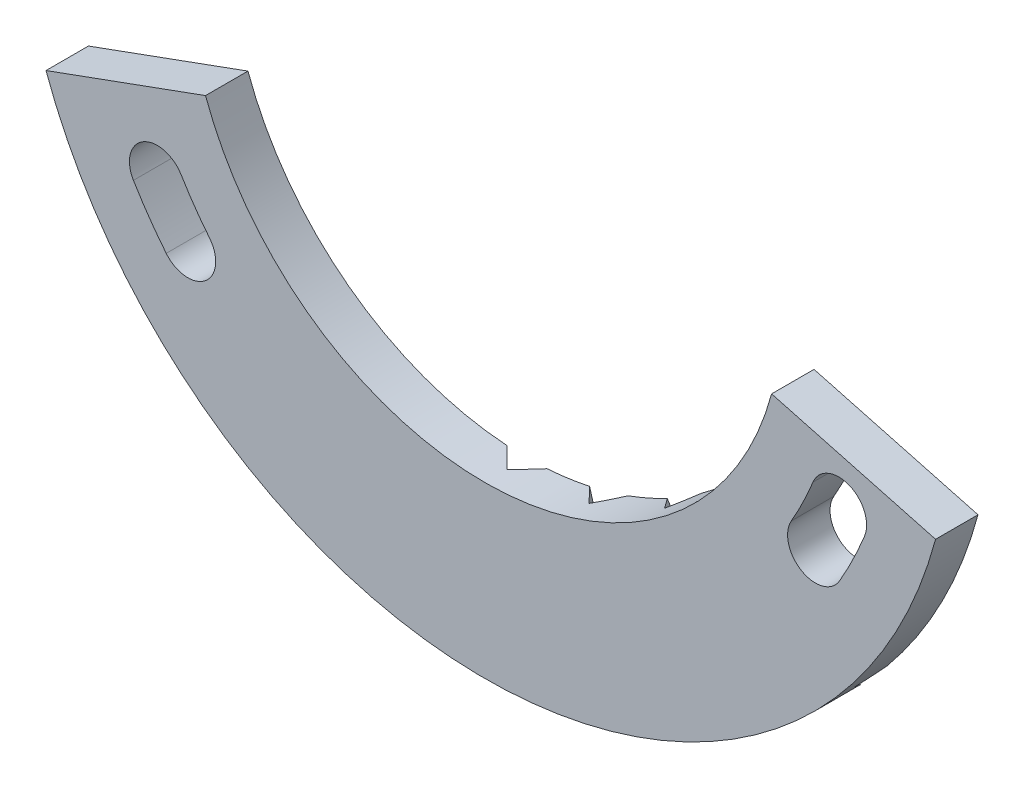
ISO-10303-21;
HEADER;
FILE_DESCRIPTION(('STEP AP214'),'2;1');
FILE_NAME('part.step','',(''),(''),'','','');
FILE_SCHEMA(('AUTOMOTIVE_DESIGN { 1 0 10303 214 1 1 1 1 }'));
ENDSEC;
DATA;
#1=APPLICATION_CONTEXT('core data for automotive mechanical design processes');
#2=APPLICATION_PROTOCOL_DEFINITION('international standard','automotive_design',2000,#1);
#3=PRODUCT_CONTEXT('',#1,'mechanical');
#4=PRODUCT('Part','Part','',(#3));
#5=PRODUCT_RELATED_PRODUCT_CATEGORY('part','',(#4));
#6=PRODUCT_DEFINITION_FORMATION('','',#4);
#7=PRODUCT_DEFINITION_CONTEXT('part definition',#1,'design');
#8=PRODUCT_DEFINITION('design','',#6,#7);
#9=PRODUCT_DEFINITION_SHAPE('','',#8);
#10=(LENGTH_UNIT() NAMED_UNIT(*) SI_UNIT(.MILLI.,.METRE.));
#11=(NAMED_UNIT(*) PLANE_ANGLE_UNIT() SI_UNIT($,.RADIAN.));
#12=(NAMED_UNIT(*) SI_UNIT($,.STERADIAN.) SOLID_ANGLE_UNIT());
#13=UNCERTAINTY_MEASURE_WITH_UNIT(LENGTH_MEASURE(1.E-05),#10,'distance_accuracy_value','');
#14=(GEOMETRIC_REPRESENTATION_CONTEXT(3) GLOBAL_UNCERTAINTY_ASSIGNED_CONTEXT((#13)) GLOBAL_UNIT_ASSIGNED_CONTEXT((#10,
#11,#12)) REPRESENTATION_CONTEXT('',''));
#15=CARTESIAN_POINT('',(0.,0.,0.));
#16=DIRECTION('',(0.,0.,1.));
#17=DIRECTION('',(1.,0.,0.));
#18=AXIS2_PLACEMENT_3D('',#15,#16,#17);
#19=CARTESIAN_POINT('',(0.,28.575,0.));
#20=DIRECTION('',(0.,0.,1.));
#21=DIRECTION('',(1.,0.,0.));
#22=AXIS2_PLACEMENT_3D('',#19,#20,#21);
#23=PLANE('',#22);
#24=CARTESIAN_POINT('',(0.,28.575,0.));
#25=DIRECTION('',(0.,0.,1.));
#26=DIRECTION('',(1.,0.,0.));
#27=AXIS2_PLACEMENT_3D('',#24,#25,#26);
#28=CIRCLE('',#27,34.925);
#29=CARTESIAN_POINT('',(11.0542762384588,-4.55442199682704,0.));
#30=VERTEX_POINT('',#29);
#31=CARTESIAN_POINT('',(17.2232039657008,-1.80783841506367,0.));
#32=VERTEX_POINT('',#31);
#33=EDGE_CURVE('E409',#30,#32,#28,.T.);
#34=ORIENTED_EDGE('',*,*,#33,.F.);
#35=DIRECTION('',(-0.275637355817,0.961261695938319,0.));
#36=VECTOR('',#35,1.);
#37=CARTESIAN_POINT('',(1.43645761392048,28.9868975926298,0.));
#38=LINE('',#37,#36);
#39=CARTESIAN_POINT('',(7.54863474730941,7.67120277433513,0.));
#40=VERTEX_POINT('',#39);
#41=EDGE_CURVE('E305',#30,#40,#38,.T.);
#42=ORIENTED_EDGE('',*,*,#41,.T.);
#43=CARTESIAN_POINT('',(0.,28.575,0.));
#44=DIRECTION('',(0.,0.,-1.));
#45=DIRECTION('',(1.,0.,0.));
#46=AXIS2_PLACEMENT_3D('',#43,#44,#45);
#47=CIRCLE('',#46,22.225);
#48=CARTESIAN_POINT('',(10.4835261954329,8.97790063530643,0.));
#49=VERTEX_POINT('',#48);
#50=EDGE_CURVE('E394',#49,#40,#47,.T.);
#51=ORIENTED_EDGE('',*,*,#50,.F.);
#52=DIRECTION('',(0.529919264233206,-0.848048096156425,0.));
#53=VECTOR('',#52,1.);
#54=CARTESIAN_POINT('',(-1.26727731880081,27.7831172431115,0.));
#55=LINE('',#54,#53);
#56=EDGE_CURVE('E287',#49,#32,#55,.T.);
#57=ORIENTED_EDGE('',*,*,#56,.T.);
#58=EDGE_LOOP('',(#34,#42,#51,#57));
#59=FACE_BOUND('',#58,.T.);
#60=ADVANCED_FACE('F37',(#59),#23,.F.);
#61=CARTESIAN_POINT('',(19.7577586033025,-0.224072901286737,0.));
#62=VERTEX_POINT('',#61);
#63=CARTESIAN_POINT('',(24.9306514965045,4.11649961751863,0.));
#64=VERTEX_POINT('',#63);
#65=EDGE_CURVE('E405',#62,#64,#28,.T.);
#66=ORIENTED_EDGE('',*,*,#65,.F.);
#67=DIRECTION('',(-0.529919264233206,0.848048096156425,0.));
#68=VECTOR('',#67,1.);
#69=CARTESIAN_POINT('',(1.26727731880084,29.3668827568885,0.));
#70=LINE('',#69,#68);
#71=CARTESIAN_POINT('',(13.0180808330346,10.5616661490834,0.));
#72=VERTEX_POINT('',#71);
#73=EDGE_CURVE('E293',#62,#72,#70,.T.);
#74=ORIENTED_EDGE('',*,*,#73,.T.);
#75=CARTESIAN_POINT('',(15.4791048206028,12.6267104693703,0.));
#76=VERTEX_POINT('',#75);
#77=EDGE_CURVE('E342',#76,#72,#47,.T.);
#78=ORIENTED_EDGE('',*,*,#77,.F.);
#79=DIRECTION('',(0.743144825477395,-0.669130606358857,0.));
#80=VECTOR('',#79,1.);
#81=CARTESIAN_POINT('',(-0.999912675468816,27.464484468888,0.));
#82=LINE('',#81,#80);
#83=EDGE_CURVE('E275',#76,#64,#82,.T.);
#84=ORIENTED_EDGE('',*,*,#83,.T.);
#85=EDGE_LOOP('',(#66,#74,#78,#84));
#86=FACE_BOUND('',#85,.T.);
#87=ADVANCED_FACE('F403',(#86),#23,.F.);
#88=CARTESIAN_POINT('',(26.4942786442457,17.8706165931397,0.));
#89=DIRECTION('',(0.,0.,1.));
#90=DIRECTION('',(1.,0.,0.));
#91=AXIS2_PLACEMENT_3D('',#88,#89,#90);
#92=CIRCLE('',#91,2.08279999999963);
#93=CARTESIAN_POINT('',(28.4254171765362,17.0903859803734,0.));
#94=VERTEX_POINT('',#93);
#95=CARTESIAN_POINT('',(24.5631401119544,18.6508472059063,0.));
#96=VERTEX_POINT('',#95);
#97=EDGE_CURVE('E245',#94,#96,#92,.T.);
#98=ORIENTED_EDGE('',*,*,#97,.T.);
#99=CARTESIAN_POINT('',(5.23886489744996E-13,28.5749999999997,0.));
#100=DIRECTION('',(0.,0.,-1.));
#101=DIRECTION('',(1.,0.,0.));
#102=AXIS2_PLACEMENT_3D('',#99,#100,#101);
#103=CIRCLE('',#102,26.4921999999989);
#104=CARTESIAN_POINT('',(22.9429182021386,15.3289000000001,0.));
#105=VERTEX_POINT('',#104);
#106=EDGE_CURVE('E235',#96,#105,#103,.T.);
#107=ORIENTED_EDGE('',*,*,#106,.T.);
#108=CARTESIAN_POINT('',(24.7466759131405,14.2875000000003,0.));
#109=DIRECTION('',(0.,0.,1.));
#110=DIRECTION('',(1.,0.,0.));
#111=AXIS2_PLACEMENT_3D('',#108,#109,#110);
#112=CIRCLE('',#111,2.08279999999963);
#113=CARTESIAN_POINT('',(26.5504336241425,13.2461000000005,0.));
#114=VERTEX_POINT('',#113);
#115=EDGE_CURVE('E238',#105,#114,#112,.T.);
#116=ORIENTED_EDGE('',*,*,#115,.T.);
#117=CARTESIAN_POINT('',(5.23886489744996E-13,28.5749999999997,0.));
#118=DIRECTION('',(0.,0.,1.));
#119=DIRECTION('',(1.,0.,0.));
#120=AXIS2_PLACEMENT_3D('',#117,#118,#119);
#121=CIRCLE('',#120,30.6577999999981);
#122=EDGE_CURVE('E242',#114,#94,#121,.T.);
#123=ORIENTED_EDGE('',*,*,#122,.T.);
#124=EDGE_LOOP('',(#98,#107,#116,#123));
#125=FACE_BOUND('',#124,.T.);
#126=CARTESIAN_POINT('',(26.9304768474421,6.3375306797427,0.));
#127=VERTEX_POINT('',#126);
#128=CARTESIAN_POINT('',(33.7349594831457,19.5357448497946,0.));
#129=VERTEX_POINT('',#128);
#130=EDGE_CURVE('E345',#127,#129,#28,.T.);
#131=ORIENTED_EDGE('',*,*,#130,.F.);
#132=DIRECTION('',(-0.743144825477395,0.669130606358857,0.));
#133=VECTOR('',#132,1.);
#134=CARTESIAN_POINT('',(0.999912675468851,29.685515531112,0.));
#135=LINE('',#134,#133);
#136=CARTESIAN_POINT('',(17.4789301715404,14.8477415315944,0.));
#137=VERTEX_POINT('',#136);
#138=EDGE_CURVE('E281',#127,#137,#135,.T.);
#139=ORIENTED_EDGE('',*,*,#138,.T.);
#140=CARTESIAN_POINT('',(21.4677014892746,22.8227467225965,0.));
#141=VERTEX_POINT('',#140);
#142=EDGE_CURVE('E338',#141,#137,#47,.T.);
#143=ORIENTED_EDGE('',*,*,#142,.F.);
#144=DIRECTION('',(-0.965925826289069,0.258819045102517,0.));
#145=VECTOR('',#144,1.);
#146=CARTESIAN_POINT('',(21.4677014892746,22.8227467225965,0.));
#147=LINE('',#146,#145);
#148=EDGE_CURVE('E331',#129,#141,#147,.T.);
#149=ORIENTED_EDGE('',*,*,#148,.F.);
#150=EDGE_LOOP('',(#131,#139,#143,#149));
#151=FACE_BOUND('',#150,.T.);
#152=ADVANCED_FACE('F431',(#125,#151),#23,.F.);
#153=CARTESIAN_POINT('',(4.6757195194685,6.84740758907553,0.));
#154=VERTEX_POINT('',#153);
#155=CARTESIAN_POINT('',(1.49434604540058,6.40029470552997,0.));
#156=VERTEX_POINT('',#155);
#157=EDGE_CURVE('E343',#154,#156,#47,.T.);
#158=ORIENTED_EDGE('',*,*,#157,.F.);
#159=DIRECTION('',(0.275637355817,-0.961261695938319,0.));
#160=VECTOR('',#159,1.);
#161=CARTESIAN_POINT('',(-1.43645761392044,28.1631024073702,0.));
#162=LINE('',#161,#160);
#163=CARTESIAN_POINT('',(8.18136101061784,-5.37821718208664,0.));
#164=VERTEX_POINT('',#163);
#165=EDGE_CURVE('E299',#154,#164,#162,.T.);
#166=ORIENTED_EDGE('',*,*,#165,.T.);
#167=CARTESIAN_POINT('',(1.49434604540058,-6.31801584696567,0.));
#168=VERTEX_POINT('',#167);
#169=EDGE_CURVE('E349',#168,#164,#28,.T.);
#170=ORIENTED_EDGE('',*,*,#169,.F.);
#171=DIRECTION('',(0.,1.,0.));
#172=VECTOR('',#171,1.);
#173=CARTESIAN_POINT('',(1.49434604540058,28.575,0.));
#174=LINE('',#173,#172);
#175=EDGE_CURVE('E365',#168,#156,#174,.T.);
#176=ORIENTED_EDGE('',*,*,#175,.T.);
#177=EDGE_LOOP('',(#158,#166,#170,#176));
#178=FACE_BOUND('',#177,.T.);
#179=ADVANCED_FACE('F391',(#178),#23,.F.);
#180=CARTESIAN_POINT('',(0.,28.575,3.175));
#181=DIRECTION('',(0.,0.,-1.));
#182=DIRECTION('',(-1.,0.,0.));
#183=AXIS2_PLACEMENT_3D('',#180,#181,#182);
#184=CYLINDRICAL_SURFACE('',#183,22.225);
#185=ORIENTED_EDGE('',*,*,#50,.T.);
#186=CARTESIAN_POINT('',(0.,28.575,1.49434604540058));
#187=DIRECTION('',(0.679714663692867,0.19490504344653,0.707106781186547));
#188=DIRECTION('',(0.679714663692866,0.19490504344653,-0.707106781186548));
#189=AXIS2_PLACEMENT_3D('',#186,#187,#188);
#190=ELLIPSE('',#189,31.4308964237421,22.225);
#191=CARTESIAN_POINT('',(6.12604023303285,7.21095880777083,1.49434604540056));
#192=VERTEX_POINT('',#191);
#193=EDGE_CURVE('E308',#40,#192,#190,.F.);
#194=ORIENTED_EDGE('',*,*,#193,.T.);
#195=CARTESIAN_POINT('',(0.,28.575,1.49434604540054));
#196=DIRECTION('',(-0.679714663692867,-0.19490504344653,0.707106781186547));
#197=DIRECTION('',(-0.679714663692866,-0.19490504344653,-0.707106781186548));
#198=AXIS2_PLACEMENT_3D('',#195,#196,#197);
#199=ELLIPSE('',#198,31.4308964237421,22.225);
#200=EDGE_CURVE('E302',#192,#154,#199,.F.);
#201=ORIENTED_EDGE('',*,*,#200,.T.);
#202=ORIENTED_EDGE('',*,*,#157,.T.);
#203=CARTESIAN_POINT('',(0.,28.575,1.49434604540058));
#204=DIRECTION('',(0.707106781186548,0.,0.707106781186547));
#205=DIRECTION('',(0.707106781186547,0.,-0.707106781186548));
#206=AXIS2_PLACEMENT_3D('',#203,#204,#205);
#207=ELLIPSE('',#206,31.4308964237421,22.225);
#208=CARTESIAN_POINT('',(0.,6.34999999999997,1.49434604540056));
#209=VERTEX_POINT('',#208);
#210=EDGE_CURVE('E323',#156,#209,#207,.F.);
#211=ORIENTED_EDGE('',*,*,#210,.T.);
#212=CARTESIAN_POINT('',(0.,28.575,1.49434604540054));
#213=DIRECTION('',(-0.707106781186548,0.,0.707106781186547));
#214=DIRECTION('',(-0.707106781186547,0.,-0.707106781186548));
#215=AXIS2_PLACEMENT_3D('',#212,#213,#214);
#216=ELLIPSE('',#215,31.4308964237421,22.225);
#217=CARTESIAN_POINT('',(-1.49434604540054,6.40029470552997,0.));
#218=VERTEX_POINT('',#217);
#219=EDGE_CURVE('E317',#209,#218,#216,.F.);
#220=ORIENTED_EDGE('',*,*,#219,.T.);
#221=CARTESIAN_POINT('',(-20.8846684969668,20.973602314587,0.));
#222=VERTEX_POINT('',#221);
#223=EDGE_CURVE('E326',#218,#222,#47,.T.);
#224=ORIENTED_EDGE('',*,*,#223,.T.);
#225=DIRECTION('',(0.,0.,-1.));
#226=VECTOR('',#225,1.);
#227=CARTESIAN_POINT('',(-20.8846684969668,20.973602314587,3.175));
#228=LINE('',#227,#226);
#229=CARTESIAN_POINT('',(-20.8846684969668,20.973602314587,3.175));
#230=VERTEX_POINT('',#229);
#231=EDGE_CURVE('E359',#230,#222,#228,.T.);
#232=ORIENTED_EDGE('',*,*,#231,.F.);
#233=CARTESIAN_POINT('',(0.,28.575,3.175));
#234=DIRECTION('',(0.,0.,-1.));
#235=DIRECTION('',(1.,0.,0.));
#236=AXIS2_PLACEMENT_3D('',#233,#234,#235);
#237=CIRCLE('',#236,22.225);
#238=CARTESIAN_POINT('',(21.4677014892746,22.8227467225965,3.175));
#239=VERTEX_POINT('',#238);
#240=EDGE_CURVE('E327',#239,#230,#237,.T.);
#241=ORIENTED_EDGE('',*,*,#240,.F.);
#242=DIRECTION('',(0.,0.,-1.));
#243=VECTOR('',#242,1.);
#244=CARTESIAN_POINT('',(21.4677014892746,22.8227467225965,3.175));
#245=LINE('',#244,#243);
#246=EDGE_CURVE('E337',#239,#141,#245,.T.);
#247=ORIENTED_EDGE('',*,*,#246,.T.);
#248=ORIENTED_EDGE('',*,*,#142,.T.);
#249=CARTESIAN_POINT('',(0.,28.575,1.49434604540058));
#250=DIRECTION('',(0.473146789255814,0.52548274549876,0.707106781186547));
#251=DIRECTION('',(0.473146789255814,0.525482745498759,-0.707106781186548));
#252=AXIS2_PLACEMENT_3D('',#249,#250,#251);
#253=ELLIPSE('',#252,31.4308964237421,22.225);
#254=CARTESIAN_POINT('',(16.5163937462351,13.7035722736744,1.49434604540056));
#255=VERTEX_POINT('',#254);
#256=EDGE_CURVE('E284',#137,#255,#253,.F.);
#257=ORIENTED_EDGE('',*,*,#256,.T.);
#258=CARTESIAN_POINT('',(0.,28.575,1.49434604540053));
#259=DIRECTION('',(-0.473146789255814,-0.52548274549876,0.707106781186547));
#260=DIRECTION('',(-0.473146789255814,-0.525482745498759,-0.707106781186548));
#261=AXIS2_PLACEMENT_3D('',#258,#259,#260);
#262=ELLIPSE('',#261,31.4308964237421,22.225);
#263=EDGE_CURVE('E278',#255,#76,#262,.F.);
#264=ORIENTED_EDGE('',*,*,#263,.T.);
#265=ORIENTED_EDGE('',*,*,#77,.T.);
#266=CARTESIAN_POINT('',(0.,28.575,1.49434604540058));
#267=DIRECTION('',(0.59966055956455,0.374709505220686,0.707106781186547));
#268=DIRECTION('',(0.599660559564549,0.374709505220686,-0.707106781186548));
#269=AXIS2_PLACEMENT_3D('',#266,#267,#268);
#270=ELLIPSE('',#269,31.4308964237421,22.225);
#271=CARTESIAN_POINT('',(11.777455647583,9.72713106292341,1.49434604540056));
#272=VERTEX_POINT('',#271);
#273=EDGE_CURVE('E296',#72,#272,#270,.F.);
#274=ORIENTED_EDGE('',*,*,#273,.T.);
#275=CARTESIAN_POINT('',(0.,28.575,1.49434604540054));
#276=DIRECTION('',(-0.59966055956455,-0.374709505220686,0.707106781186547));
#277=DIRECTION('',(-0.599660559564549,-0.374709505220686,-0.707106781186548));
#278=AXIS2_PLACEMENT_3D('',#275,#276,#277);
#279=ELLIPSE('',#278,31.4308964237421,22.225);
#280=EDGE_CURVE('E290',#272,#49,#279,.F.);
#281=ORIENTED_EDGE('',*,*,#280,.T.);
#282=EDGE_LOOP('',(#185,#194,#201,#202,#211,#220,#224,#232,#241,#247,#248,#257,#264,#265,#274,#281));
#283=FACE_BOUND('',#282,.T.);
#284=ADVANCED_FACE('F39',(#283),#184,.F.);
#285=CARTESIAN_POINT('',(-20.8846684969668,20.973602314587,3.175));
#286=DIRECTION('',(0.342020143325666,-0.939692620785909,0.));
#287=DIRECTION('',(0.939692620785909,0.342020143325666,0.));
#288=AXIS2_PLACEMENT_3D('',#285,#286,#287);
#289=PLANE('',#288);
#290=DIRECTION('',(-0.939692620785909,-0.342020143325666,0.));
#291=VECTOR('',#290,1.);
#292=CARTESIAN_POINT('',(-20.8846684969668,20.973602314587,0.));
#293=LINE('',#292,#291);
#294=CARTESIAN_POINT('',(-32.8187647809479,16.6299464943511,0.));
#295=VERTEX_POINT('',#294);
#296=EDGE_CURVE('E341',#222,#295,#293,.T.);
#297=ORIENTED_EDGE('',*,*,#296,.T.);
#298=DIRECTION('',(0.,0.,-1.));
#299=VECTOR('',#298,1.);
#300=CARTESIAN_POINT('',(-32.8187647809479,16.6299464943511,3.175));
#301=LINE('',#300,#299);
#302=CARTESIAN_POINT('',(-32.8187647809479,16.6299464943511,3.175));
#303=VERTEX_POINT('',#302);
#304=EDGE_CURVE('E356',#303,#295,#301,.T.);
#305=ORIENTED_EDGE('',*,*,#304,.F.);
#306=DIRECTION('',(-0.939692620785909,-0.342020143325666,0.));
#307=VECTOR('',#306,1.);
#308=CARTESIAN_POINT('',(-20.8846684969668,20.973602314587,3.175));
#309=LINE('',#308,#307);
#310=EDGE_CURVE('E330',#230,#303,#309,.T.);
#311=ORIENTED_EDGE('',*,*,#310,.F.);
#312=ORIENTED_EDGE('',*,*,#231,.T.);
#313=EDGE_LOOP('',(#297,#305,#311,#312));
#314=FACE_BOUND('',#313,.T.);
#315=ADVANCED_FACE('F451',(#314),#289,.F.);
#316=CARTESIAN_POINT('',(0.,28.575,3.175));
#317=DIRECTION('',(0.,0.,-1.));
#318=DIRECTION('',(-1.,0.,0.));
#319=AXIS2_PLACEMENT_3D('',#316,#317,#318);
#320=CYLINDRICAL_SURFACE('',#319,34.925);
#321=CARTESIAN_POINT('',(0.,28.575,1.49434604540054));
#322=DIRECTION('',(-0.679714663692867,-0.19490504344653,0.707106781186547));
#323=DIRECTION('',(-0.679714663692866,-0.19490504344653,-0.707106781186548));
#324=AXIS2_PLACEMENT_3D('',#321,#322,#323);
#325=ELLIPSE('',#324,49.3914086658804,34.925);
#326=CARTESIAN_POINT('',(9.62663465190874,-4.99706473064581,1.49434604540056));
#327=VERTEX_POINT('',#326);
#328=EDGE_CURVE('E45',#164,#327,#325,.T.);
#329=ORIENTED_EDGE('',*,*,#328,.T.);
#330=CARTESIAN_POINT('',(0.,28.575,1.49434604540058));
#331=DIRECTION('',(0.679714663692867,0.19490504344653,0.707106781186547));
#332=DIRECTION('',(0.679714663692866,0.19490504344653,-0.707106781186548));
#333=AXIS2_PLACEMENT_3D('',#330,#331,#332);
#334=ELLIPSE('',#333,49.3914086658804,34.925);
#335=EDGE_CURVE('E11',#327,#30,#334,.T.);
#336=ORIENTED_EDGE('',*,*,#335,.T.);
#337=ORIENTED_EDGE('',*,*,#33,.T.);
#338=CARTESIAN_POINT('',(0.,28.575,1.49434604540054));
#339=DIRECTION('',(-0.59966055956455,-0.374709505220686,0.707106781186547));
#340=DIRECTION('',(-0.599660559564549,-0.374709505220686,-0.707106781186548));
#341=AXIS2_PLACEMENT_3D('',#338,#339,#340);
#342=ELLIPSE('',#341,49.3914086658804,34.925);
#343=CARTESIAN_POINT('',(18.5074303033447,-1.04307975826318,1.49434604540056));
#344=VERTEX_POINT('',#343);
#345=EDGE_CURVE('E374',#32,#344,#342,.T.);
#346=ORIENTED_EDGE('',*,*,#345,.T.);
#347=CARTESIAN_POINT('',(0.,28.575,1.49434604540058));
#348=DIRECTION('',(0.59966055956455,0.374709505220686,0.707106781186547));
#349=DIRECTION('',(0.599660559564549,0.374709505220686,-0.707106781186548));
#350=AXIS2_PLACEMENT_3D('',#347,#348,#349);
#351=ELLIPSE('',#350,49.3914086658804,34.925);
#352=EDGE_CURVE('E377',#344,#62,#351,.T.);
#353=ORIENTED_EDGE('',*,*,#352,.T.);
#354=ORIENTED_EDGE('',*,*,#65,.T.);
#355=CARTESIAN_POINT('',(0.,28.575,1.49434604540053));
#356=DIRECTION('',(-0.473146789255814,-0.52548274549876,0.707106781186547));
#357=DIRECTION('',(-0.473146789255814,-0.525482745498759,-0.707106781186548));
#358=AXIS2_PLACEMENT_3D('',#355,#356,#357);
#359=ELLIPSE('',#358,49.3914086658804,34.925);
#360=CARTESIAN_POINT('',(25.9543330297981,5.2056135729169,1.49434604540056));
#361=VERTEX_POINT('',#360);
#362=EDGE_CURVE('E368',#64,#361,#359,.T.);
#363=ORIENTED_EDGE('',*,*,#362,.T.);
#364=CARTESIAN_POINT('',(0.,28.575,1.49434604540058));
#365=DIRECTION('',(0.473146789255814,0.52548274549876,0.707106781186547));
#366=DIRECTION('',(0.473146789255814,0.525482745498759,-0.707106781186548));
#367=AXIS2_PLACEMENT_3D('',#364,#365,#366);
#368=ELLIPSE('',#367,49.3914086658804,34.925);
#369=EDGE_CURVE('E371',#361,#127,#368,.T.);
#370=ORIENTED_EDGE('',*,*,#369,.T.);
#371=ORIENTED_EDGE('',*,*,#130,.T.);
#372=DIRECTION('',(0.,0.,-1.));
#373=VECTOR('',#372,1.);
#374=CARTESIAN_POINT('',(33.7349594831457,19.5357448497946,3.175));
#375=LINE('',#374,#373);
#376=CARTESIAN_POINT('',(33.7349594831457,19.5357448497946,3.175));
#377=VERTEX_POINT('',#376);
#378=EDGE_CURVE('E353',#377,#129,#375,.T.);
#379=ORIENTED_EDGE('',*,*,#378,.F.);
#380=CARTESIAN_POINT('',(0.,28.575,3.175));
#381=DIRECTION('',(0.,0.,1.));
#382=DIRECTION('',(1.,0.,0.));
#383=AXIS2_PLACEMENT_3D('',#380,#381,#382);
#384=CIRCLE('',#383,34.925);
#385=EDGE_CURVE('E333',#303,#377,#384,.T.);
#386=ORIENTED_EDGE('',*,*,#385,.F.);
#387=ORIENTED_EDGE('',*,*,#304,.T.);
#388=CARTESIAN_POINT('',(-1.49434604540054,-6.31801584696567,0.));
#389=VERTEX_POINT('',#388);
#390=EDGE_CURVE('E346',#295,#389,#28,.T.);
#391=ORIENTED_EDGE('',*,*,#390,.T.);
#392=CARTESIAN_POINT('',(0.,28.575,1.49434604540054));
#393=DIRECTION('',(-0.707106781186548,0.,0.707106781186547));
#394=DIRECTION('',(-0.707106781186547,0.,-0.707106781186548));
#395=AXIS2_PLACEMENT_3D('',#392,#393,#394);
#396=ELLIPSE('',#395,49.3914086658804,34.925);
#397=CARTESIAN_POINT('',(0.,-6.35000000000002,1.49434604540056));
#398=VERTEX_POINT('',#397);
#399=EDGE_CURVE('E314',#389,#398,#396,.T.);
#400=ORIENTED_EDGE('',*,*,#399,.T.);
#401=CARTESIAN_POINT('',(0.,28.575,1.49434604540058));
#402=DIRECTION('',(0.707106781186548,0.,0.707106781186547));
#403=DIRECTION('',(0.707106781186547,0.,-0.707106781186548));
#404=AXIS2_PLACEMENT_3D('',#401,#402,#403);
#405=ELLIPSE('',#404,49.3914086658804,34.925);
#406=EDGE_CURVE('E320',#398,#168,#405,.T.);
#407=ORIENTED_EDGE('',*,*,#406,.T.);
#408=ORIENTED_EDGE('',*,*,#169,.T.);
#409=EDGE_LOOP('',(#329,#336,#337,#346,#353,#354,#363,#370,#371,#379,#386,#387,#391,#400,#407,#408));
#410=FACE_BOUND('',#409,.T.);
#411=ADVANCED_FACE('F382',(#410),#320,.T.);
#412=CARTESIAN_POINT('',(21.4677014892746,22.8227467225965,3.175));
#413=DIRECTION('',(-0.258819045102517,-0.965925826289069,0.));
#414=DIRECTION('',(0.96592582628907,-0.258819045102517,0.));
#415=AXIS2_PLACEMENT_3D('',#412,#413,#414);
#416=PLANE('',#415);
#417=ORIENTED_EDGE('',*,*,#148,.T.);
#418=ORIENTED_EDGE('',*,*,#246,.F.);
#419=DIRECTION('',(-0.965925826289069,0.258819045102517,0.));
#420=VECTOR('',#419,1.);
#421=CARTESIAN_POINT('',(21.4677014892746,22.8227467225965,3.175));
#422=LINE('',#421,#420);
#423=EDGE_CURVE('E335',#377,#239,#422,.T.);
#424=ORIENTED_EDGE('',*,*,#423,.F.);
#425=ORIENTED_EDGE('',*,*,#378,.T.);
#426=EDGE_LOOP('',(#417,#418,#424,#425));
#427=FACE_BOUND('',#426,.T.);
#428=ADVANCED_FACE('F444',(#427),#416,.F.);
#429=CARTESIAN_POINT('',(0.,28.575,3.175));
#430=DIRECTION('',(0.,0.,1.));
#431=DIRECTION('',(1.,0.,0.));
#432=AXIS2_PLACEMENT_3D('',#429,#430,#431);
#433=PLANE('',#432);
#434=CARTESIAN_POINT('',(5.23886489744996E-13,28.5749999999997,3.175));
#435=DIRECTION('',(0.,0.,1.));
#436=DIRECTION('',(1.,0.,0.));
#437=AXIS2_PLACEMENT_3D('',#434,#435,#436);
#438=CIRCLE('',#437,30.6578000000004);
#439=CARTESIAN_POINT('',(-26.2788636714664,12.7850657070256,3.175));
#440=VERTEX_POINT('',#439);
#441=CARTESIAN_POINT('',(-23.8255854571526,9.28142131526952,3.175));
#442=VERTEX_POINT('',#441);
#443=EDGE_CURVE('E52',#440,#442,#438,.T.);
#444=ORIENTED_EDGE('',*,*,#443,.F.);
#445=CARTESIAN_POINT('',(-24.4935556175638,13.8577870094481,3.175));
#446=DIRECTION('',(0.,0.,1.));
#447=DIRECTION('',(1.,0.,0.));
#448=AXIS2_PLACEMENT_3D('',#445,#446,#447);
#449=CIRCLE('',#448,2.08280000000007);
#450=CARTESIAN_POINT('',(-22.7082475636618,14.9305083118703,3.175));
#451=VERTEX_POINT('',#450);
#452=EDGE_CURVE('E216',#451,#440,#449,.T.);
#453=ORIENTED_EDGE('',*,*,#452,.F.);
#454=CARTESIAN_POINT('',(5.23886489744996E-13,28.5749999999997,3.175));
#455=DIRECTION('',(0.,0.,-1.));
#456=DIRECTION('',(1.,0.,0.));
#457=AXIS2_PLACEMENT_3D('',#454,#455,#456);
#458=CIRCLE('',#457,26.4922000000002);
#459=CARTESIAN_POINT('',(-20.5883062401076,11.9029183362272,3.175));
#460=VERTEX_POINT('',#459);
#461=EDGE_CURVE('E219',#460,#451,#458,.T.);
#462=ORIENTED_EDGE('',*,*,#461,.F.);
#463=CARTESIAN_POINT('',(-22.2069458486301,10.5921698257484,3.175));
#464=DIRECTION('',(0.,0.,1.));
#465=DIRECTION('',(1.,0.,0.));
#466=AXIS2_PLACEMENT_3D('',#463,#464,#465);
#467=CIRCLE('',#466,2.08280000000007);
#468=EDGE_CURVE('E225',#442,#460,#467,.T.);
#469=ORIENTED_EDGE('',*,*,#468,.F.);
#470=EDGE_LOOP('',(#444,#453,#462,#469));
#471=FACE_BOUND('',#470,.T.);
#472=CARTESIAN_POINT('',(5.23886489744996E-13,28.5749999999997,3.175));
#473=DIRECTION('',(0.,0.,-1.));
#474=DIRECTION('',(1.,0.,0.));
#475=AXIS2_PLACEMENT_3D('',#472,#473,#474);
#476=CIRCLE('',#475,26.4921999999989);
#477=CARTESIAN_POINT('',(24.5631401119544,18.6508472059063,3.175));
#478=VERTEX_POINT('',#477);
#479=CARTESIAN_POINT('',(22.9429182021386,15.3289000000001,3.175));
#480=VERTEX_POINT('',#479);
#481=EDGE_CURVE('E231',#478,#480,#476,.T.);
#482=ORIENTED_EDGE('',*,*,#481,.F.);
#483=CARTESIAN_POINT('',(26.4942786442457,17.8706165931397,3.175));
#484=DIRECTION('',(0.,0.,1.));
#485=DIRECTION('',(1.,0.,0.));
#486=AXIS2_PLACEMENT_3D('',#483,#484,#485);
#487=CIRCLE('',#486,2.08279999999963);
#488=CARTESIAN_POINT('',(28.4254171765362,17.0903859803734,3.175));
#489=VERTEX_POINT('',#488);
#490=EDGE_CURVE('E239',#489,#478,#487,.T.);
#491=ORIENTED_EDGE('',*,*,#490,.F.);
#492=CARTESIAN_POINT('',(5.23886489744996E-13,28.5749999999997,3.175));
#493=DIRECTION('',(0.,0.,1.));
#494=DIRECTION('',(1.,0.,0.));
#495=AXIS2_PLACEMENT_3D('',#492,#493,#494);
#496=CIRCLE('',#495,30.6577999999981);
#497=CARTESIAN_POINT('',(26.5504336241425,13.2461000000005,3.175));
#498=VERTEX_POINT('',#497);
#499=EDGE_CURVE('E253',#498,#489,#496,.T.);
#500=ORIENTED_EDGE('',*,*,#499,.F.);
#501=CARTESIAN_POINT('',(24.7466759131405,14.2875000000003,3.175));
#502=DIRECTION('',(0.,0.,1.));
#503=DIRECTION('',(1.,0.,0.));
#504=AXIS2_PLACEMENT_3D('',#501,#502,#503);
#505=CIRCLE('',#504,2.08279999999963);
#506=EDGE_CURVE('E250',#480,#498,#505,.T.);
#507=ORIENTED_EDGE('',*,*,#506,.F.);
#508=EDGE_LOOP('',(#482,#491,#500,#507));
#509=FACE_BOUND('',#508,.T.);
#510=ORIENTED_EDGE('',*,*,#240,.T.);
#511=ORIENTED_EDGE('',*,*,#310,.T.);
#512=ORIENTED_EDGE('',*,*,#385,.T.);
#513=ORIENTED_EDGE('',*,*,#423,.T.);
#514=EDGE_LOOP('',(#510,#511,#512,#513));
#515=FACE_BOUND('',#514,.T.);
#516=ADVANCED_FACE('F436',(#471,#509,#515),#433,.T.);
#517=CARTESIAN_POINT('',(-24.4935556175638,13.8577870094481,0.));
#518=DIRECTION('',(0.,0.,1.));
#519=DIRECTION('',(1.,0.,0.));
#520=AXIS2_PLACEMENT_3D('',#517,#518,#519);
#521=CIRCLE('',#520,2.08280000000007);
#522=CARTESIAN_POINT('',(-22.7082475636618,14.9305083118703,0.));
#523=VERTEX_POINT('',#522);
#524=CARTESIAN_POINT('',(-26.2788636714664,12.7850657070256,0.));
#525=VERTEX_POINT('',#524);
#526=EDGE_CURVE('E206',#523,#525,#521,.T.);
#527=ORIENTED_EDGE('',*,*,#526,.T.);
#528=CARTESIAN_POINT('',(5.23886489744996E-13,28.5749999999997,0.));
#529=DIRECTION('',(0.,0.,1.));
#530=DIRECTION('',(1.,0.,0.));
#531=AXIS2_PLACEMENT_3D('',#528,#529,#530);
#532=CIRCLE('',#531,30.6578000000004);
#533=CARTESIAN_POINT('',(-23.8255854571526,9.28142131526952,0.));
#534=VERTEX_POINT('',#533);
#535=EDGE_CURVE('E200',#525,#534,#532,.T.);
#536=ORIENTED_EDGE('',*,*,#535,.T.);
#537=CARTESIAN_POINT('',(-22.2069458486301,10.5921698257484,0.));
#538=DIRECTION('',(0.,0.,1.));
#539=DIRECTION('',(1.,0.,0.));
#540=AXIS2_PLACEMENT_3D('',#537,#538,#539);
#541=CIRCLE('',#540,2.08280000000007);
#542=CARTESIAN_POINT('',(-20.5883062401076,11.9029183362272,0.));
#543=VERTEX_POINT('',#542);
#544=EDGE_CURVE('E209',#534,#543,#541,.T.);
#545=ORIENTED_EDGE('',*,*,#544,.T.);
#546=CARTESIAN_POINT('',(5.23886489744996E-13,28.5749999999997,0.));
#547=DIRECTION('',(0.,0.,-1.));
#548=DIRECTION('',(1.,0.,0.));
#549=AXIS2_PLACEMENT_3D('',#546,#547,#548);
#550=CIRCLE('',#549,26.4922000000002);
#551=EDGE_CURVE('E60',#543,#523,#550,.T.);
#552=ORIENTED_EDGE('',*,*,#551,.T.);
#553=EDGE_LOOP('',(#527,#536,#545,#552));
#554=FACE_BOUND('',#553,.T.);
#555=ORIENTED_EDGE('',*,*,#223,.F.);
#556=DIRECTION('',(0.,-1.,0.));
#557=VECTOR('',#556,1.);
#558=CARTESIAN_POINT('',(-1.49434604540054,28.575,0.));
#559=LINE('',#558,#557);
#560=EDGE_CURVE('E362',#218,#389,#559,.T.);
#561=ORIENTED_EDGE('',*,*,#560,.T.);
#562=ORIENTED_EDGE('',*,*,#390,.F.);
#563=ORIENTED_EDGE('',*,*,#296,.F.);
#564=EDGE_LOOP('',(#555,#561,#562,#563));
#565=FACE_BOUND('',#564,.T.);
#566=ADVANCED_FACE('F213',(#554,#565),#23,.F.);
#567=CARTESIAN_POINT('',(0.,-12.7,1.49434604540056));
#568=DIRECTION('',(0.707106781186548,0.,0.707106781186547));
#569=DIRECTION('',(0.707106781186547,0.,-0.707106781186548));
#570=AXIS2_PLACEMENT_3D('',#567,#568,#569);
#571=PLANE('',#570);
#572=ORIENTED_EDGE('',*,*,#175,.F.);
#573=ORIENTED_EDGE('',*,*,#406,.F.);
#574=DIRECTION('',(0.,1.,0.));
#575=VECTOR('',#574,1.);
#576=CARTESIAN_POINT('',(0.,-12.7,1.49434604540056));
#577=LINE('',#576,#575);
#578=EDGE_CURVE('E311',#398,#209,#577,.T.);
#579=ORIENTED_EDGE('',*,*,#578,.T.);
#580=ORIENTED_EDGE('',*,*,#210,.F.);
#581=EDGE_LOOP('',(#572,#573,#579,#580));
#582=FACE_BOUND('',#581,.T.);
#583=ADVANCED_FACE('F435',(#582),#571,.F.);
#584=CARTESIAN_POINT('',(-3.78034604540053,-12.7,-2.286));
#585=DIRECTION('',(-0.707106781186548,0.,0.707106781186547));
#586=DIRECTION('',(0.707106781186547,0.,0.707106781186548));
#587=AXIS2_PLACEMENT_3D('',#584,#585,#586);
#588=PLANE('',#587);
#589=ORIENTED_EDGE('',*,*,#578,.F.);
#590=ORIENTED_EDGE('',*,*,#399,.F.);
#591=ORIENTED_EDGE('',*,*,#560,.F.);
#592=ORIENTED_EDGE('',*,*,#219,.F.);
#593=EDGE_LOOP('',(#589,#590,#591,#592));
#594=FACE_BOUND('',#593,.T.);
#595=ADVANCED_FACE('F441',(#594),#588,.F.);
#596=CARTESIAN_POINT('',(28.1437574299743,-1.85271037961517,-2.286));
#597=DIRECTION('',(-0.473146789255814,-0.52548274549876,0.707106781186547));
#598=DIRECTION('',(0.,-0.80263330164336,-0.596472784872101));
#599=AXIS2_PLACEMENT_3D('',#596,#597,#598);
#600=PLANE('',#599);
#601=DIRECTION('',(-0.743144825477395,0.669130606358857,0.));
#602=VECTOR('',#601,1.);
#603=CARTESIAN_POINT('',(30.6733026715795,0.956634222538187,1.49434604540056));
#604=LINE('',#603,#602);
#605=EDGE_CURVE('E260',#361,#255,#604,.T.);
#606=ORIENTED_EDGE('',*,*,#605,.F.);
#607=ORIENTED_EDGE('',*,*,#362,.F.);
#608=ORIENTED_EDGE('',*,*,#83,.F.);
#609=ORIENTED_EDGE('',*,*,#263,.F.);
#610=EDGE_LOOP('',(#606,#607,#608,#609));
#611=FACE_BOUND('',#610,.T.);
#612=ADVANCED_FACE('F474',(#611),#600,.F.);
#613=CARTESIAN_POINT('',(30.6733026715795,0.956634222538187,1.49434604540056));
#614=DIRECTION('',(0.473146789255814,0.52548274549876,0.707106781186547));
#615=DIRECTION('',(0.,-0.80263330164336,0.596472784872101));
#616=AXIS2_PLACEMENT_3D('',#613,#614,#615);
#617=PLANE('',#616);
#618=ORIENTED_EDGE('',*,*,#138,.F.);
#619=ORIENTED_EDGE('',*,*,#369,.F.);
#620=ORIENTED_EDGE('',*,*,#605,.T.);
#621=ORIENTED_EDGE('',*,*,#256,.F.);
#622=EDGE_LOOP('',(#618,#619,#620,#621));
#623=FACE_BOUND('',#622,.T.);
#624=ADVANCED_FACE('F479',(#623),#617,.F.);
#625=CARTESIAN_POINT('',(18.6665023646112,-8.43146336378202,-2.286));
#626=DIRECTION('',(-0.59966055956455,-0.374709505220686,0.707106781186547));
#627=DIRECTION('',(0.762673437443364,0.,0.646783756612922));
#628=AXIS2_PLACEMENT_3D('',#625,#626,#627);
#629=PLANE('',#628);
#630=DIRECTION('',(-0.529919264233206,0.848048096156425,0.));
#631=VECTOR('',#630,1.);
#632=CARTESIAN_POINT('',(21.8724176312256,-6.42818516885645,1.49434604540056));
#633=LINE('',#632,#631);
#634=EDGE_CURVE('E269',#344,#272,#633,.T.);
#635=ORIENTED_EDGE('',*,*,#634,.F.);
#636=ORIENTED_EDGE('',*,*,#345,.F.);
#637=ORIENTED_EDGE('',*,*,#56,.F.);
#638=ORIENTED_EDGE('',*,*,#280,.F.);
#639=EDGE_LOOP('',(#635,#636,#637,#638));
#640=FACE_BOUND('',#639,.T.);
#641=ADVANCED_FACE('F411',(#640),#629,.F.);
#642=CARTESIAN_POINT('',(21.8724176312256,-6.42818516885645,1.49434604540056));
#643=DIRECTION('',(0.59966055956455,0.374709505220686,0.707106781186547));
#644=DIRECTION('',(0.762673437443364,0.,-0.646783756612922));
#645=AXIS2_PLACEMENT_3D('',#642,#643,#644);
#646=PLANE('',#645);
#647=ORIENTED_EDGE('',*,*,#73,.F.);
#648=ORIENTED_EDGE('',*,*,#352,.F.);
#649=ORIENTED_EDGE('',*,*,#634,.T.);
#650=ORIENTED_EDGE('',*,*,#273,.F.);
#651=EDGE_LOOP('',(#647,#648,#649,#650));
#652=FACE_BOUND('',#651,.T.);
#653=ADVANCED_FACE('F408',(#652),#646,.F.);
#654=CARTESIAN_POINT('',(11.3769318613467,-11.1010764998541,1.49434604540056));
#655=DIRECTION('',(0.679714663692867,0.19490504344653,0.707106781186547));
#656=DIRECTION('',(0.720932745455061,0.,-0.693005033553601));
#657=AXIS2_PLACEMENT_3D('',#654,#655,#656);
#658=PLANE('',#657);
#659=ORIENTED_EDGE('',*,*,#41,.F.);
#660=ORIENTED_EDGE('',*,*,#335,.F.);
#661=DIRECTION('',(-0.275637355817,0.961261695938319,0.));
#662=VECTOR('',#661,1.);
#663=CARTESIAN_POINT('',(11.3769318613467,-11.1010764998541,1.49434604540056));
#664=LINE('',#663,#662);
#665=EDGE_CURVE('E272',#327,#192,#664,.T.);
#666=ORIENTED_EDGE('',*,*,#665,.T.);
#667=ORIENTED_EDGE('',*,*,#193,.F.);
#668=EDGE_LOOP('',(#659,#660,#666,#667));
#669=FACE_BOUND('',#668,.T.);
#670=ADVANCED_FACE('F415',(#669),#658,.F.);
#671=CARTESIAN_POINT('',(7.74303001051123,-12.1430810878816,-2.286));
#672=DIRECTION('',(-0.679714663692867,-0.19490504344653,0.707106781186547));
#673=DIRECTION('',(0.720932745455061,0.,0.693005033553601));
#674=AXIS2_PLACEMENT_3D('',#671,#672,#673);
#675=PLANE('',#674);
#676=ORIENTED_EDGE('',*,*,#665,.F.);
#677=ORIENTED_EDGE('',*,*,#328,.F.);
#678=ORIENTED_EDGE('',*,*,#165,.F.);
#679=ORIENTED_EDGE('',*,*,#200,.F.);
#680=EDGE_LOOP('',(#676,#677,#678,#679));
#681=FACE_BOUND('',#680,.T.);
#682=ADVANCED_FACE('F388',(#681),#675,.F.);
#683=CARTESIAN_POINT('',(5.23886489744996E-13,28.5749999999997,0.));
#684=DIRECTION('',(0.,0.,1.));
#685=DIRECTION('',(1.,0.,0.));
#686=AXIS2_PLACEMENT_3D('',#683,#684,#685);
#687=CYLINDRICAL_SURFACE('',#686,26.4921999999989);
#688=ORIENTED_EDGE('',*,*,#481,.T.);
#689=DIRECTION('',(0.,0.,1.));
#690=VECTOR('',#689,1.);
#691=CARTESIAN_POINT('',(22.9429182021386,15.3289000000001,0.));
#692=LINE('',#691,#690);
#693=EDGE_CURVE('E248',#105,#480,#692,.T.);
#694=ORIENTED_EDGE('',*,*,#693,.F.);
#695=ORIENTED_EDGE('',*,*,#106,.F.);
#696=DIRECTION('',(0.,0.,1.));
#697=VECTOR('',#696,1.);
#698=CARTESIAN_POINT('',(24.5631401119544,18.6508472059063,0.));
#699=LINE('',#698,#697);
#700=EDGE_CURVE('E258',#96,#478,#699,.T.);
#701=ORIENTED_EDGE('',*,*,#700,.T.);
#702=EDGE_LOOP('',(#688,#694,#695,#701));
#703=FACE_BOUND('',#702,.T.);
#704=ADVANCED_FACE('F422',(#703),#687,.T.);
#705=CARTESIAN_POINT('',(26.4942786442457,17.8706165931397,0.));
#706=DIRECTION('',(0.,0.,1.));
#707=DIRECTION('',(1.,0.,0.));
#708=AXIS2_PLACEMENT_3D('',#705,#706,#707);
#709=CYLINDRICAL_SURFACE('',#708,2.08279999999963);
#710=ORIENTED_EDGE('',*,*,#490,.T.);
#711=ORIENTED_EDGE('',*,*,#700,.F.);
#712=ORIENTED_EDGE('',*,*,#97,.F.);
#713=DIRECTION('',(0.,0.,1.));
#714=VECTOR('',#713,1.);
#715=CARTESIAN_POINT('',(28.4254171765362,17.0903859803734,0.));
#716=LINE('',#715,#714);
#717=EDGE_CURVE('E261',#94,#489,#716,.T.);
#718=ORIENTED_EDGE('',*,*,#717,.T.);
#719=EDGE_LOOP('',(#710,#711,#712,#718));
#720=FACE_BOUND('',#719,.T.);
#721=ADVANCED_FACE('F518',(#720),#709,.F.);
#722=CARTESIAN_POINT('',(5.23886489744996E-13,28.5749999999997,0.));
#723=DIRECTION('',(0.,0.,1.));
#724=DIRECTION('',(1.,0.,0.));
#725=AXIS2_PLACEMENT_3D('',#722,#723,#724);
#726=CYLINDRICAL_SURFACE('',#725,30.6577999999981);
#727=ORIENTED_EDGE('',*,*,#499,.T.);
#728=ORIENTED_EDGE('',*,*,#717,.F.);
#729=ORIENTED_EDGE('',*,*,#122,.F.);
#730=DIRECTION('',(0.,0.,1.));
#731=VECTOR('',#730,1.);
#732=CARTESIAN_POINT('',(26.5504336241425,13.2461000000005,0.));
#733=LINE('',#732,#731);
#734=EDGE_CURVE('E263',#114,#498,#733,.T.);
#735=ORIENTED_EDGE('',*,*,#734,.T.);
#736=EDGE_LOOP('',(#727,#728,#729,#735));
#737=FACE_BOUND('',#736,.T.);
#738=ADVANCED_FACE('F525',(#737),#726,.F.);
#739=CARTESIAN_POINT('',(24.7466759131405,14.2875000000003,0.));
#740=DIRECTION('',(0.,0.,1.));
#741=DIRECTION('',(1.,0.,0.));
#742=AXIS2_PLACEMENT_3D('',#739,#740,#741);
#743=CYLINDRICAL_SURFACE('',#742,2.08279999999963);
#744=ORIENTED_EDGE('',*,*,#506,.T.);
#745=ORIENTED_EDGE('',*,*,#734,.F.);
#746=ORIENTED_EDGE('',*,*,#115,.F.);
#747=ORIENTED_EDGE('',*,*,#693,.T.);
#748=EDGE_LOOP('',(#744,#745,#746,#747));
#749=FACE_BOUND('',#748,.T.);
#750=ADVANCED_FACE('F533',(#749),#743,.F.);
#751=CARTESIAN_POINT('',(5.23886489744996E-13,28.5749999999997,0.));
#752=DIRECTION('',(0.,0.,1.));
#753=DIRECTION('',(1.,0.,0.));
#754=AXIS2_PLACEMENT_3D('',#751,#752,#753);
#755=CYLINDRICAL_SURFACE('',#754,30.6578000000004);
#756=ORIENTED_EDGE('',*,*,#443,.T.);
#757=DIRECTION('',(0.,0.,1.));
#758=VECTOR('',#757,1.);
#759=CARTESIAN_POINT('',(-23.8255854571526,9.28142131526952,0.));
#760=LINE('',#759,#758);
#761=EDGE_CURVE('E196',#534,#442,#760,.T.);
#762=ORIENTED_EDGE('',*,*,#761,.F.);
#763=ORIENTED_EDGE('',*,*,#535,.F.);
#764=DIRECTION('',(0.,0.,1.));
#765=VECTOR('',#764,1.);
#766=CARTESIAN_POINT('',(-26.2788636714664,12.7850657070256,0.));
#767=LINE('',#766,#765);
#768=EDGE_CURVE('E229',#525,#440,#767,.T.);
#769=ORIENTED_EDGE('',*,*,#768,.T.);
#770=EDGE_LOOP('',(#756,#762,#763,#769));
#771=FACE_BOUND('',#770,.T.);
#772=ADVANCED_FACE('F198',(#771),#755,.F.);
#773=CARTESIAN_POINT('',(-24.4935556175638,13.8577870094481,0.));
#774=DIRECTION('',(0.,0.,1.));
#775=DIRECTION('',(1.,0.,0.));
#776=AXIS2_PLACEMENT_3D('',#773,#774,#775);
#777=CYLINDRICAL_SURFACE('',#776,2.08280000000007);
#778=ORIENTED_EDGE('',*,*,#452,.T.);
#779=ORIENTED_EDGE('',*,*,#768,.F.);
#780=ORIENTED_EDGE('',*,*,#526,.F.);
#781=DIRECTION('',(0.,0.,1.));
#782=VECTOR('',#781,1.);
#783=CARTESIAN_POINT('',(-22.7082475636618,14.9305083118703,0.));
#784=LINE('',#783,#782);
#785=EDGE_CURVE('E232',#523,#451,#784,.T.);
#786=ORIENTED_EDGE('',*,*,#785,.T.);
#787=EDGE_LOOP('',(#778,#779,#780,#786));
#788=FACE_BOUND('',#787,.T.);
#789=ADVANCED_FACE('F548',(#788),#777,.F.);
#790=CARTESIAN_POINT('',(5.23886489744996E-13,28.5749999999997,0.));
#791=DIRECTION('',(0.,0.,1.));
#792=DIRECTION('',(1.,0.,0.));
#793=AXIS2_PLACEMENT_3D('',#790,#791,#792);
#794=CYLINDRICAL_SURFACE('',#793,26.4922000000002);
#795=ORIENTED_EDGE('',*,*,#461,.T.);
#796=ORIENTED_EDGE('',*,*,#785,.F.);
#797=ORIENTED_EDGE('',*,*,#551,.F.);
#798=DIRECTION('',(0.,0.,1.));
#799=VECTOR('',#798,1.);
#800=CARTESIAN_POINT('',(-20.5883062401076,11.9029183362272,0.));
#801=LINE('',#800,#799);
#802=EDGE_CURVE('E205',#543,#460,#801,.T.);
#803=ORIENTED_EDGE('',*,*,#802,.T.);
#804=EDGE_LOOP('',(#795,#796,#797,#803));
#805=FACE_BOUND('',#804,.T.);
#806=ADVANCED_FACE('F555',(#805),#794,.T.);
#807=CARTESIAN_POINT('',(-22.2069458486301,10.5921698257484,0.));
#808=DIRECTION('',(0.,0.,1.));
#809=DIRECTION('',(1.,0.,0.));
#810=AXIS2_PLACEMENT_3D('',#807,#808,#809);
#811=CYLINDRICAL_SURFACE('',#810,2.08280000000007);
#812=ORIENTED_EDGE('',*,*,#468,.T.);
#813=ORIENTED_EDGE('',*,*,#802,.F.);
#814=ORIENTED_EDGE('',*,*,#544,.F.);
#815=ORIENTED_EDGE('',*,*,#761,.T.);
#816=EDGE_LOOP('',(#812,#813,#814,#815));
#817=FACE_BOUND('',#816,.T.);
#818=ADVANCED_FACE('F210',(#817),#811,.F.);
#819=CLOSED_SHELL('',(#60,#87,#152,#179,#284,#315,#411,#428,#516,#566,#583,#595,#612,#624,#641,
#653,#670,#682,#704,#721,#738,#750,#772,#789,#806,#818));
#820=MANIFOLD_SOLID_BREP('B2',#819);
#821=ADVANCED_BREP_SHAPE_REPRESENTATION('',(#18,#820),#14);
#822=SHAPE_DEFINITION_REPRESENTATION(#9,#821);
ENDSEC;
END-ISO-10303-21;
